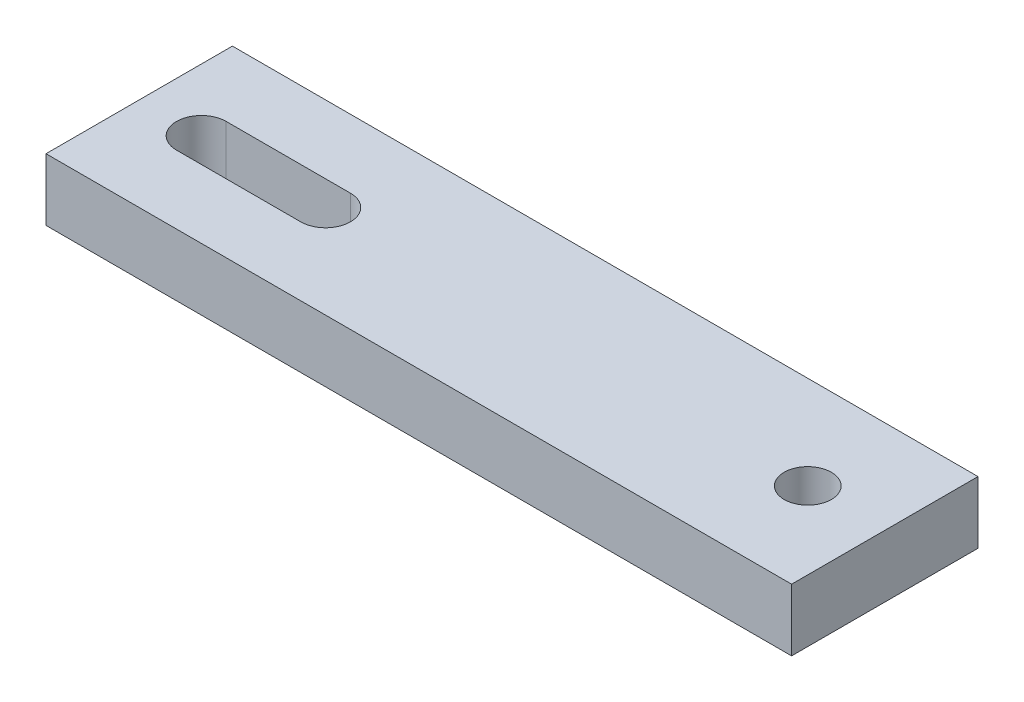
ISO-10303-21;
HEADER;
FILE_DESCRIPTION(('STEP AP214'),'2;1');
FILE_NAME('part.step','',(''),(''),'','','');
FILE_SCHEMA(('AUTOMOTIVE_DESIGN { 1 0 10303 214 1 1 1 1 }'));
ENDSEC;
DATA;
#1=APPLICATION_CONTEXT('core data for automotive mechanical design processes');
#2=APPLICATION_PROTOCOL_DEFINITION('international standard','automotive_design',2000,#1);
#3=PRODUCT_CONTEXT('',#1,'mechanical');
#4=PRODUCT('Part','Part','',(#3));
#5=PRODUCT_RELATED_PRODUCT_CATEGORY('part','',(#4));
#6=PRODUCT_DEFINITION_FORMATION('','',#4);
#7=PRODUCT_DEFINITION_CONTEXT('part definition',#1,'design');
#8=PRODUCT_DEFINITION('design','',#6,#7);
#9=PRODUCT_DEFINITION_SHAPE('','',#8);
#10=(LENGTH_UNIT() NAMED_UNIT(*) SI_UNIT(.MILLI.,.METRE.));
#11=(NAMED_UNIT(*) PLANE_ANGLE_UNIT() SI_UNIT($,.RADIAN.));
#12=(NAMED_UNIT(*) SI_UNIT($,.STERADIAN.) SOLID_ANGLE_UNIT());
#13=UNCERTAINTY_MEASURE_WITH_UNIT(LENGTH_MEASURE(1.E-05),#10,'distance_accuracy_value','');
#14=(GEOMETRIC_REPRESENTATION_CONTEXT(3) GLOBAL_UNCERTAINTY_ASSIGNED_CONTEXT((#13)) GLOBAL_UNIT_ASSIGNED_CONTEXT((#10,
#11,#12)) REPRESENTATION_CONTEXT('',''));
#15=CARTESIAN_POINT('',(0.,0.,0.));
#16=DIRECTION('',(0.,0.,1.));
#17=DIRECTION('',(1.,0.,0.));
#18=AXIS2_PLACEMENT_3D('',#15,#16,#17);
#19=CARTESIAN_POINT('',(0.,6.35,0.));
#20=DIRECTION('',(1.,0.,0.));
#21=DIRECTION('',(0.,0.,-1.));
#22=AXIS2_PLACEMENT_3D('',#19,#20,#21);
#23=PLANE('',#22);
#24=DIRECTION('',(0.,0.,1.));
#25=VECTOR('',#24,1.);
#26=CARTESIAN_POINT('',(0.,0.,0.));
#27=LINE('',#26,#25);
#28=CARTESIAN_POINT('',(0.,0.,-19.05));
#29=VERTEX_POINT('',#28);
#30=CARTESIAN_POINT('',(0.,0.,0.));
#31=VERTEX_POINT('',#30);
#32=EDGE_CURVE('E130',#29,#31,#27,.T.);
#33=ORIENTED_EDGE('',*,*,#32,.T.);
#34=DIRECTION('',(0.,-1.,0.));
#35=VECTOR('',#34,1.);
#36=CARTESIAN_POINT('',(0.,6.35,0.));
#37=LINE('',#36,#35);
#38=CARTESIAN_POINT('',(0.,6.35,0.));
#39=VERTEX_POINT('',#38);
#40=EDGE_CURVE('E11',#39,#31,#37,.T.);
#41=ORIENTED_EDGE('',*,*,#40,.F.);
#42=DIRECTION('',(0.,0.,1.));
#43=VECTOR('',#42,1.);
#44=CARTESIAN_POINT('',(0.,6.35,0.));
#45=LINE('',#44,#43);
#46=CARTESIAN_POINT('',(0.,6.35,-19.05));
#47=VERTEX_POINT('',#46);
#48=EDGE_CURVE('E142',#47,#39,#45,.T.);
#49=ORIENTED_EDGE('',*,*,#48,.F.);
#50=DIRECTION('',(0.,-1.,0.));
#51=VECTOR('',#50,1.);
#52=CARTESIAN_POINT('',(0.,6.35,-19.05));
#53=LINE('',#52,#51);
#54=EDGE_CURVE('E151',#47,#29,#53,.T.);
#55=ORIENTED_EDGE('',*,*,#54,.T.);
#56=EDGE_LOOP('',(#33,#41,#49,#55));
#57=FACE_BOUND('',#56,.T.);
#58=ADVANCED_FACE('F30',(#57),#23,.F.);
#59=CARTESIAN_POINT('',(0.,6.35,0.));
#60=DIRECTION('',(0.,0.,-1.));
#61=DIRECTION('',(-1.,0.,0.));
#62=AXIS2_PLACEMENT_3D('',#59,#60,#61);
#63=PLANE('',#62);
#64=DIRECTION('',(1.,0.,0.));
#65=VECTOR('',#64,1.);
#66=CARTESIAN_POINT('',(0.,0.,0.));
#67=LINE('',#66,#65);
#68=CARTESIAN_POINT('',(76.2,0.,0.));
#69=VERTEX_POINT('',#68);
#70=EDGE_CURVE('E136',#31,#69,#67,.T.);
#71=ORIENTED_EDGE('',*,*,#70,.T.);
#72=DIRECTION('',(0.,-1.,0.));
#73=VECTOR('',#72,1.);
#74=CARTESIAN_POINT('',(76.2,6.35,0.));
#75=LINE('',#74,#73);
#76=CARTESIAN_POINT('',(76.2,6.35,0.));
#77=VERTEX_POINT('',#76);
#78=EDGE_CURVE('E37',#77,#69,#75,.T.);
#79=ORIENTED_EDGE('',*,*,#78,.F.);
#80=DIRECTION('',(1.,0.,0.));
#81=VECTOR('',#80,1.);
#82=CARTESIAN_POINT('',(0.,6.35,0.));
#83=LINE('',#82,#81);
#84=EDGE_CURVE('E145',#39,#77,#83,.T.);
#85=ORIENTED_EDGE('',*,*,#84,.F.);
#86=ORIENTED_EDGE('',*,*,#40,.T.);
#87=EDGE_LOOP('',(#71,#79,#85,#86));
#88=FACE_BOUND('',#87,.T.);
#89=ADVANCED_FACE('F175',(#88),#63,.F.);
#90=CARTESIAN_POINT('',(76.2,6.35,0.));
#91=DIRECTION('',(-1.,0.,0.));
#92=DIRECTION('',(0.,0.,1.));
#93=AXIS2_PLACEMENT_3D('',#90,#91,#92);
#94=PLANE('',#93);
#95=DIRECTION('',(0.,0.,-1.));
#96=VECTOR('',#95,1.);
#97=CARTESIAN_POINT('',(76.2,0.,0.));
#98=LINE('',#97,#96);
#99=CARTESIAN_POINT('',(76.2,0.,-19.05));
#100=VERTEX_POINT('',#99);
#101=EDGE_CURVE('E138',#69,#100,#98,.T.);
#102=ORIENTED_EDGE('',*,*,#101,.T.);
#103=DIRECTION('',(0.,-1.,0.));
#104=VECTOR('',#103,1.);
#105=CARTESIAN_POINT('',(76.2,6.35,-19.05));
#106=LINE('',#105,#104);
#107=CARTESIAN_POINT('',(76.2,6.35,-19.05));
#108=VERTEX_POINT('',#107);
#109=EDGE_CURVE('E154',#108,#100,#106,.T.);
#110=ORIENTED_EDGE('',*,*,#109,.F.);
#111=DIRECTION('',(0.,0.,-1.));
#112=VECTOR('',#111,1.);
#113=CARTESIAN_POINT('',(76.2,6.35,0.));
#114=LINE('',#113,#112);
#115=EDGE_CURVE('E147',#77,#108,#114,.T.);
#116=ORIENTED_EDGE('',*,*,#115,.F.);
#117=ORIENTED_EDGE('',*,*,#78,.T.);
#118=EDGE_LOOP('',(#102,#110,#116,#117));
#119=FACE_BOUND('',#118,.T.);
#120=ADVANCED_FACE('F161',(#119),#94,.F.);
#121=CARTESIAN_POINT('',(0.,6.35,-19.05));
#122=DIRECTION('',(0.,0.,1.));
#123=DIRECTION('',(1.,0.,0.));
#124=AXIS2_PLACEMENT_3D('',#121,#122,#123);
#125=PLANE('',#124);
#126=DIRECTION('',(-1.,0.,0.));
#127=VECTOR('',#126,1.);
#128=CARTESIAN_POINT('',(0.,0.,-19.05));
#129=LINE('',#128,#127);
#130=EDGE_CURVE('E140',#100,#29,#129,.T.);
#131=ORIENTED_EDGE('',*,*,#130,.T.);
#132=ORIENTED_EDGE('',*,*,#54,.F.);
#133=DIRECTION('',(-1.,0.,0.));
#134=VECTOR('',#133,1.);
#135=CARTESIAN_POINT('',(0.,6.35,-19.05));
#136=LINE('',#135,#134);
#137=EDGE_CURVE('E149',#108,#47,#136,.T.);
#138=ORIENTED_EDGE('',*,*,#137,.F.);
#139=ORIENTED_EDGE('',*,*,#109,.T.);
#140=EDGE_LOOP('',(#131,#132,#138,#139));
#141=FACE_BOUND('',#140,.T.);
#142=ADVANCED_FACE('F168',(#141),#125,.F.);
#143=CARTESIAN_POINT('',(0.,6.35,-19.05));
#144=DIRECTION('',(0.,-1.,0.));
#145=DIRECTION('',(0.,0.,-1.));
#146=AXIS2_PLACEMENT_3D('',#143,#144,#145);
#147=PLANE('',#146);
#148=CARTESIAN_POINT('',(68.326,6.35,-9.525));
#149=DIRECTION('',(0.,1.,0.));
#150=DIRECTION('',(0.,0.,1.));
#151=AXIS2_PLACEMENT_3D('',#148,#149,#150);
#152=CIRCLE('',#151,2.41299999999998);
#153=CARTESIAN_POINT('',(68.326,6.35,-7.11200000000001));
#154=VERTEX_POINT('',#153);
#155=EDGE_CURVE('E212',#154,#154,#152,.T.);
#156=ORIENTED_EDGE('',*,*,#155,.F.);
#157=EDGE_LOOP('',(#156));
#158=FACE_BOUND('',#157,.T.);
#159=DIRECTION('',(1.,0.,0.));
#160=VECTOR('',#159,1.);
#161=CARTESIAN_POINT('',(6.35,6.35,-6.985));
#162=LINE('',#161,#160);
#163=CARTESIAN_POINT('',(6.35,6.35,-6.985));
#164=VERTEX_POINT('',#163);
#165=CARTESIAN_POINT('',(19.05,6.35,-6.985));
#166=VERTEX_POINT('',#165);
#167=EDGE_CURVE('E124',#164,#166,#162,.T.);
#168=ORIENTED_EDGE('',*,*,#167,.F.);
#169=CARTESIAN_POINT('',(6.35,6.35,-9.525));
#170=DIRECTION('',(0.,1.,0.));
#171=DIRECTION('',(0.,0.,1.));
#172=AXIS2_PLACEMENT_3D('',#169,#170,#171);
#173=CIRCLE('',#172,2.54);
#174=CARTESIAN_POINT('',(6.35,6.35,-12.065));
#175=VERTEX_POINT('',#174);
#176=EDGE_CURVE('E44',#175,#164,#173,.T.);
#177=ORIENTED_EDGE('',*,*,#176,.F.);
#178=DIRECTION('',(-1.,0.,0.));
#179=VECTOR('',#178,1.);
#180=CARTESIAN_POINT('',(6.35,6.35,-12.065));
#181=LINE('',#180,#179);
#182=CARTESIAN_POINT('',(19.05,6.35,-12.065));
#183=VERTEX_POINT('',#182);
#184=EDGE_CURVE('E112',#183,#175,#181,.T.);
#185=ORIENTED_EDGE('',*,*,#184,.F.);
#186=CARTESIAN_POINT('',(19.05,6.35,-9.52500000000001));
#187=DIRECTION('',(0.,1.,0.));
#188=DIRECTION('',(0.,0.,1.));
#189=AXIS2_PLACEMENT_3D('',#186,#187,#188);
#190=CIRCLE('',#189,2.54);
#191=EDGE_CURVE('E115',#166,#183,#190,.T.);
#192=ORIENTED_EDGE('',*,*,#191,.F.);
#193=EDGE_LOOP('',(#168,#177,#185,#192));
#194=FACE_BOUND('',#193,.T.);
#195=ORIENTED_EDGE('',*,*,#48,.T.);
#196=ORIENTED_EDGE('',*,*,#84,.T.);
#197=ORIENTED_EDGE('',*,*,#115,.T.);
#198=ORIENTED_EDGE('',*,*,#137,.T.);
#199=EDGE_LOOP('',(#195,#196,#197,#198));
#200=FACE_BOUND('',#199,.T.);
#201=ADVANCED_FACE('F174',(#158,#194,#200),#147,.F.);
#202=CARTESIAN_POINT('',(0.,0.,-19.05));
#203=DIRECTION('',(0.,-1.,0.));
#204=DIRECTION('',(0.,0.,-1.));
#205=AXIS2_PLACEMENT_3D('',#202,#203,#204);
#206=PLANE('',#205);
#207=CARTESIAN_POINT('',(68.326,0.,-9.525));
#208=DIRECTION('',(0.,1.,0.));
#209=DIRECTION('',(0.,0.,1.));
#210=AXIS2_PLACEMENT_3D('',#207,#208,#209);
#211=CIRCLE('',#210,2.413);
#212=CARTESIAN_POINT('',(68.326,0.,-7.112));
#213=VERTEX_POINT('',#212);
#214=EDGE_CURVE('E118',#213,#213,#211,.T.);
#215=ORIENTED_EDGE('',*,*,#214,.T.);
#216=EDGE_LOOP('',(#215));
#217=FACE_BOUND('',#216,.T.);
#218=CARTESIAN_POINT('',(6.35,0.,-9.525));
#219=DIRECTION('',(0.,1.,0.));
#220=DIRECTION('',(0.,0.,1.));
#221=AXIS2_PLACEMENT_3D('',#218,#219,#220);
#222=CIRCLE('',#221,2.54);
#223=CARTESIAN_POINT('',(6.35,0.,-12.065));
#224=VERTEX_POINT('',#223);
#225=CARTESIAN_POINT('',(6.35,0.,-6.985));
#226=VERTEX_POINT('',#225);
#227=EDGE_CURVE('E96',#224,#226,#222,.T.);
#228=ORIENTED_EDGE('',*,*,#227,.T.);
#229=DIRECTION('',(1.,0.,0.));
#230=VECTOR('',#229,1.);
#231=CARTESIAN_POINT('',(6.35,0.,-6.985));
#232=LINE('',#231,#230);
#233=CARTESIAN_POINT('',(19.05,0.,-6.985));
#234=VERTEX_POINT('',#233);
#235=EDGE_CURVE('E105',#226,#234,#232,.T.);
#236=ORIENTED_EDGE('',*,*,#235,.T.);
#237=CARTESIAN_POINT('',(19.05,0.,-9.52500000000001));
#238=DIRECTION('',(0.,1.,0.));
#239=DIRECTION('',(0.,0.,1.));
#240=AXIS2_PLACEMENT_3D('',#237,#238,#239);
#241=CIRCLE('',#240,2.54);
#242=CARTESIAN_POINT('',(19.05,0.,-12.065));
#243=VERTEX_POINT('',#242);
#244=EDGE_CURVE('E52',#234,#243,#241,.T.);
#245=ORIENTED_EDGE('',*,*,#244,.T.);
#246=DIRECTION('',(-1.,0.,0.));
#247=VECTOR('',#246,1.);
#248=CARTESIAN_POINT('',(6.35,0.,-12.065));
#249=LINE('',#248,#247);
#250=EDGE_CURVE('E102',#243,#224,#249,.T.);
#251=ORIENTED_EDGE('',*,*,#250,.T.);
#252=EDGE_LOOP('',(#228,#236,#245,#251));
#253=FACE_BOUND('',#252,.T.);
#254=ORIENTED_EDGE('',*,*,#32,.F.);
#255=ORIENTED_EDGE('',*,*,#130,.F.);
#256=ORIENTED_EDGE('',*,*,#101,.F.);
#257=ORIENTED_EDGE('',*,*,#70,.F.);
#258=EDGE_LOOP('',(#254,#255,#256,#257));
#259=FACE_BOUND('',#258,.T.);
#260=ADVANCED_FACE('F109',(#217,#253,#259),#206,.T.);
#261=CARTESIAN_POINT('',(6.35,0.,-9.525));
#262=DIRECTION('',(0.,1.,0.));
#263=DIRECTION('',(0.,0.,1.));
#264=AXIS2_PLACEMENT_3D('',#261,#262,#263);
#265=CYLINDRICAL_SURFACE('',#264,2.54);
#266=ORIENTED_EDGE('',*,*,#176,.T.);
#267=DIRECTION('',(0.,1.,0.));
#268=VECTOR('',#267,1.);
#269=CARTESIAN_POINT('',(6.35,0.,-6.985));
#270=LINE('',#269,#268);
#271=EDGE_CURVE('E92',#226,#164,#270,.T.);
#272=ORIENTED_EDGE('',*,*,#271,.F.);
#273=ORIENTED_EDGE('',*,*,#227,.F.);
#274=DIRECTION('',(0.,1.,0.));
#275=VECTOR('',#274,1.);
#276=CARTESIAN_POINT('',(6.35,0.,-12.065));
#277=LINE('',#276,#275);
#278=EDGE_CURVE('E128',#224,#175,#277,.T.);
#279=ORIENTED_EDGE('',*,*,#278,.T.);
#280=EDGE_LOOP('',(#266,#272,#273,#279));
#281=FACE_BOUND('',#280,.T.);
#282=ADVANCED_FACE('F94',(#281),#265,.F.);
#283=CARTESIAN_POINT('',(6.35,0.,-12.065));
#284=DIRECTION('',(0.,0.,-1.));
#285=DIRECTION('',(-1.,0.,0.));
#286=AXIS2_PLACEMENT_3D('',#283,#284,#285);
#287=PLANE('',#286);
#288=ORIENTED_EDGE('',*,*,#184,.T.);
#289=ORIENTED_EDGE('',*,*,#278,.F.);
#290=ORIENTED_EDGE('',*,*,#250,.F.);
#291=DIRECTION('',(0.,1.,0.));
#292=VECTOR('',#291,1.);
#293=CARTESIAN_POINT('',(19.05,0.,-12.065));
#294=LINE('',#293,#292);
#295=EDGE_CURVE('E131',#243,#183,#294,.T.);
#296=ORIENTED_EDGE('',*,*,#295,.T.);
#297=EDGE_LOOP('',(#288,#289,#290,#296));
#298=FACE_BOUND('',#297,.T.);
#299=ADVANCED_FACE('F193',(#298),#287,.F.);
#300=CARTESIAN_POINT('',(19.05,0.,-9.52500000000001));
#301=DIRECTION('',(0.,1.,0.));
#302=DIRECTION('',(0.,0.,1.));
#303=AXIS2_PLACEMENT_3D('',#300,#301,#302);
#304=CYLINDRICAL_SURFACE('',#303,2.54);
#305=ORIENTED_EDGE('',*,*,#191,.T.);
#306=ORIENTED_EDGE('',*,*,#295,.F.);
#307=ORIENTED_EDGE('',*,*,#244,.F.);
#308=DIRECTION('',(0.,1.,0.));
#309=VECTOR('',#308,1.);
#310=CARTESIAN_POINT('',(19.05,0.,-6.985));
#311=LINE('',#310,#309);
#312=EDGE_CURVE('E101',#234,#166,#311,.T.);
#313=ORIENTED_EDGE('',*,*,#312,.T.);
#314=EDGE_LOOP('',(#305,#306,#307,#313));
#315=FACE_BOUND('',#314,.T.);
#316=ADVANCED_FACE('F197',(#315),#304,.F.);
#317=CARTESIAN_POINT('',(6.35,0.,-6.985));
#318=DIRECTION('',(0.,0.,1.));
#319=DIRECTION('',(1.,0.,0.));
#320=AXIS2_PLACEMENT_3D('',#317,#318,#319);
#321=PLANE('',#320);
#322=ORIENTED_EDGE('',*,*,#167,.T.);
#323=ORIENTED_EDGE('',*,*,#312,.F.);
#324=ORIENTED_EDGE('',*,*,#235,.F.);
#325=ORIENTED_EDGE('',*,*,#271,.T.);
#326=EDGE_LOOP('',(#322,#323,#324,#325));
#327=FACE_BOUND('',#326,.T.);
#328=ADVANCED_FACE('F106',(#327),#321,.F.);
#329=CARTESIAN_POINT('',(68.326,6.35,-9.525));
#330=DIRECTION('',(0.,1.,0.));
#331=DIRECTION('',(0.,0.,1.));
#332=AXIS2_PLACEMENT_3D('',#329,#330,#331);
#333=CYLINDRICAL_SURFACE('',#332,2.41299999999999);
#334=ORIENTED_EDGE('',*,*,#214,.F.);
#335=EDGE_LOOP('',(#334));
#336=FACE_BOUND('',#335,.T.);
#337=ORIENTED_EDGE('',*,*,#155,.T.);
#338=EDGE_LOOP('',(#337));
#339=FACE_BOUND('',#338,.T.);
#340=ADVANCED_FACE('F196',(#336,#339),#333,.F.);
#341=CLOSED_SHELL('',(#58,#89,#120,#142,#201,#260,#282,#299,#316,#328,#340));
#342=MANIFOLD_SOLID_BREP('B2',#341);
#343=ADVANCED_BREP_SHAPE_REPRESENTATION('',(#18,#342),#14);
#344=SHAPE_DEFINITION_REPRESENTATION(#9,#343);
ENDSEC;
END-ISO-10303-21;
